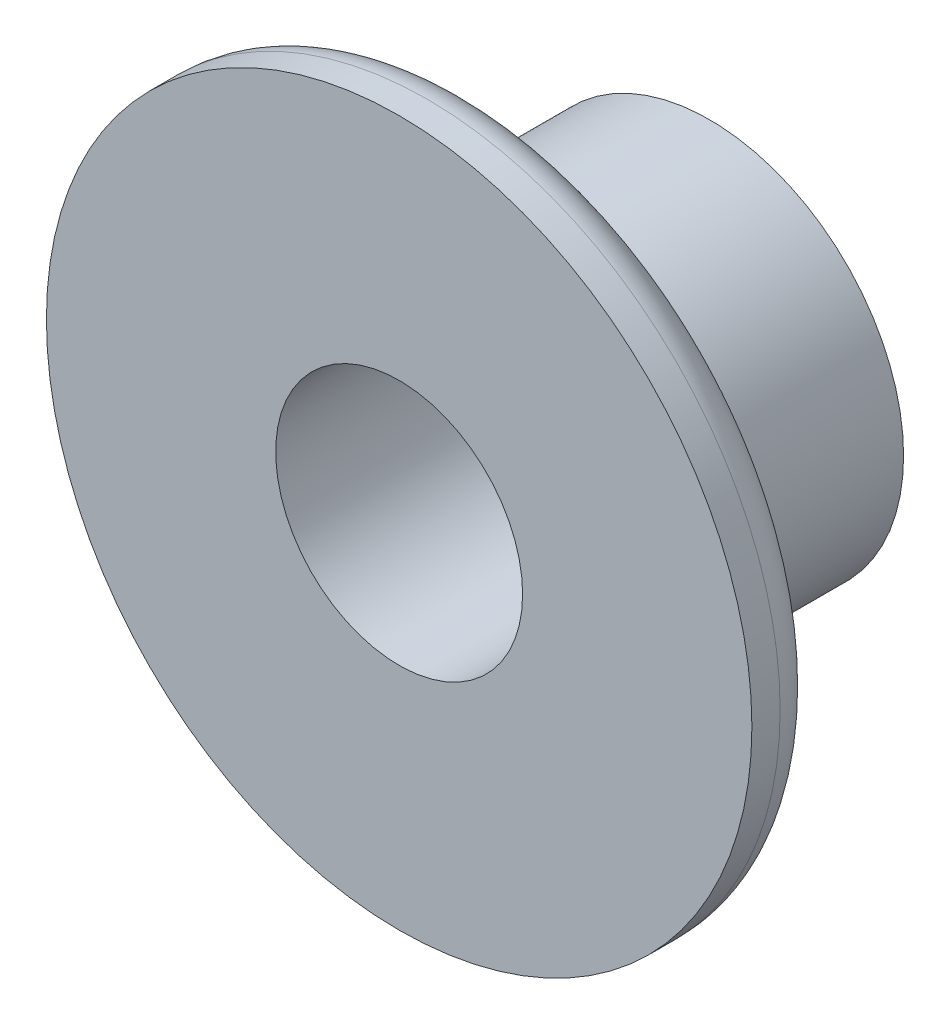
ISO-10303-21;
HEADER;
FILE_DESCRIPTION(('STEP AP214'),'2;1');
FILE_NAME('part.step','',(''),(''),'','','');
FILE_SCHEMA(('AUTOMOTIVE_DESIGN { 1 0 10303 214 1 1 1 1 }'));
ENDSEC;
DATA;
#1=APPLICATION_CONTEXT('core data for automotive mechanical design processes');
#2=APPLICATION_PROTOCOL_DEFINITION('international standard','automotive_design',2000,#1);
#3=PRODUCT_CONTEXT('',#1,'mechanical');
#4=PRODUCT('Part','Part','',(#3));
#5=PRODUCT_RELATED_PRODUCT_CATEGORY('part','',(#4));
#6=PRODUCT_DEFINITION_FORMATION('','',#4);
#7=PRODUCT_DEFINITION_CONTEXT('part definition',#1,'design');
#8=PRODUCT_DEFINITION('design','',#6,#7);
#9=PRODUCT_DEFINITION_SHAPE('','',#8);
#10=(LENGTH_UNIT() NAMED_UNIT(*) SI_UNIT(.MILLI.,.METRE.));
#11=(NAMED_UNIT(*) PLANE_ANGLE_UNIT() SI_UNIT($,.RADIAN.));
#12=(NAMED_UNIT(*) SI_UNIT($,.STERADIAN.) SOLID_ANGLE_UNIT());
#13=UNCERTAINTY_MEASURE_WITH_UNIT(LENGTH_MEASURE(1.E-05),#10,'distance_accuracy_value','');
#14=(GEOMETRIC_REPRESENTATION_CONTEXT(3) GLOBAL_UNCERTAINTY_ASSIGNED_CONTEXT((#13)) GLOBAL_UNIT_ASSIGNED_CONTEXT((#10,
#11,#12)) REPRESENTATION_CONTEXT('',''));
#15=CARTESIAN_POINT('',(0.,0.,0.));
#16=DIRECTION('',(0.,0.,1.));
#17=DIRECTION('',(1.,0.,0.));
#18=AXIS2_PLACEMENT_3D('',#15,#16,#17);
#19=CARTESIAN_POINT('',(0.,0.,5.588));
#20=DIRECTION('',(0.,0.,-1.));
#21=DIRECTION('',(-1.,0.,0.));
#22=AXIS2_PLACEMENT_3D('',#19,#20,#21);
#23=CYLINDRICAL_SURFACE('',#22,3.4925);
#24=CARTESIAN_POINT('',(0.,0.,3.556));
#25=DIRECTION('',(0.,0.,1.));
#26=DIRECTION('',(1.,0.,0.));
#27=AXIS2_PLACEMENT_3D('',#24,#25,#26);
#28=CIRCLE('',#27,3.4925);
#29=CARTESIAN_POINT('',(3.4925,0.,3.556));
#30=VERTEX_POINT('',#29);
#31=EDGE_CURVE('E37',#30,#30,#28,.F.);
#32=ORIENTED_EDGE('',*,*,#31,.T.);
#33=EDGE_LOOP('',(#32));
#34=FACE_BOUND('',#33,.T.);
#35=CARTESIAN_POINT('',(0.,0.,0.));
#36=DIRECTION('',(0.,0.,1.));
#37=DIRECTION('',(1.,0.,0.));
#38=AXIS2_PLACEMENT_3D('',#35,#36,#37);
#39=CIRCLE('',#38,3.4925);
#40=CARTESIAN_POINT('',(3.4925,0.,0.));
#41=VERTEX_POINT('',#40);
#42=EDGE_CURVE('E50',#41,#41,#39,.T.);
#43=ORIENTED_EDGE('',*,*,#42,.T.);
#44=EDGE_LOOP('',(#43));
#45=FACE_BOUND('',#44,.T.);
#46=ADVANCED_FACE('F30',(#34,#45),#23,.T.);
#47=CARTESIAN_POINT('',(0.,0.,5.588));
#48=DIRECTION('',(0.,0.,1.));
#49=DIRECTION('',(1.,0.,0.));
#50=AXIS2_PLACEMENT_3D('',#47,#48,#49);
#51=PLANE('',#50);
#52=CARTESIAN_POINT('',(0.,0.,5.588));
#53=DIRECTION('',(0.,0.,1.));
#54=DIRECTION('',(1.,0.,0.));
#55=AXIS2_PLACEMENT_3D('',#52,#53,#54);
#56=CIRCLE('',#55,2.2225);
#57=CARTESIAN_POINT('',(2.2225,0.,5.588));
#58=VERTEX_POINT('',#57);
#59=EDGE_CURVE('E53',#58,#58,#56,.T.);
#60=ORIENTED_EDGE('',*,*,#59,.F.);
#61=EDGE_LOOP('',(#60));
#62=FACE_BOUND('',#61,.T.);
#63=CARTESIAN_POINT('',(0.,0.,5.588));
#64=DIRECTION('',(0.,0.,1.));
#65=DIRECTION('',(1.,0.,0.));
#66=AXIS2_PLACEMENT_3D('',#63,#64,#65);
#67=CIRCLE('',#66,6.35);
#68=CARTESIAN_POINT('',(6.35,0.,5.588));
#69=VERTEX_POINT('',#68);
#70=EDGE_CURVE('E57',#69,#69,#67,.T.);
#71=ORIENTED_EDGE('',*,*,#70,.T.);
#72=EDGE_LOOP('',(#71));
#73=FACE_BOUND('',#72,.T.);
#74=ADVANCED_FACE('F63',(#62,#73),#51,.T.);
#75=CARTESIAN_POINT('',(0.,0.,0.));
#76=DIRECTION('',(0.,0.,1.));
#77=DIRECTION('',(1.,0.,0.));
#78=AXIS2_PLACEMENT_3D('',#75,#76,#77);
#79=PLANE('',#78);
#80=ORIENTED_EDGE('',*,*,#42,.F.);
#81=EDGE_LOOP('',(#80));
#82=FACE_BOUND('',#81,.T.);
#83=CARTESIAN_POINT('',(0.,0.,0.));
#84=DIRECTION('',(0.,0.,1.));
#85=DIRECTION('',(1.,0.,0.));
#86=AXIS2_PLACEMENT_3D('',#83,#84,#85);
#87=CIRCLE('',#86,2.2225);
#88=CARTESIAN_POINT('',(2.2225,0.,0.));
#89=VERTEX_POINT('',#88);
#90=EDGE_CURVE('E54',#89,#89,#87,.T.);
#91=ORIENTED_EDGE('',*,*,#90,.T.);
#92=EDGE_LOOP('',(#91));
#93=FACE_BOUND('',#92,.T.);
#94=ADVANCED_FACE('F84',(#82,#93),#79,.F.);
#95=CARTESIAN_POINT('',(0.,0.,5.588));
#96=DIRECTION('',(0.,0.,-1.));
#97=DIRECTION('',(-1.,0.,0.));
#98=AXIS2_PLACEMENT_3D('',#95,#96,#97);
#99=CYLINDRICAL_SURFACE('',#98,2.2225);
#100=ORIENTED_EDGE('',*,*,#59,.T.);
#101=EDGE_LOOP('',(#100));
#102=FACE_BOUND('',#101,.T.);
#103=ORIENTED_EDGE('',*,*,#90,.F.);
#104=EDGE_LOOP('',(#103));
#105=FACE_BOUND('',#104,.T.);
#106=ADVANCED_FACE('F75',(#102,#105),#99,.F.);
#107=CARTESIAN_POINT('',(0.,0.,4.318));
#108=DIRECTION('',(0.,0.,1.));
#109=DIRECTION('',(1.,0.,0.));
#110=AXIS2_PLACEMENT_3D('',#107,#108,#109);
#111=PLANE('',#110);
#112=CARTESIAN_POINT('',(0.,0.,4.318));
#113=DIRECTION('',(0.,0.,1.));
#114=DIRECTION('',(1.,0.,0.));
#115=AXIS2_PLACEMENT_3D('',#112,#113,#114);
#116=CIRCLE('',#115,4.2545);
#117=CARTESIAN_POINT('',(4.2545,0.,4.318));
#118=VERTEX_POINT('',#117);
#119=EDGE_CURVE('E41',#118,#118,#116,.T.);
#120=ORIENTED_EDGE('',*,*,#119,.T.);
#121=EDGE_LOOP('',(#120));
#122=FACE_BOUND('',#121,.T.);
#123=CARTESIAN_POINT('',(0.,0.,4.318));
#124=DIRECTION('',(0.,0.,1.));
#125=DIRECTION('',(1.,0.,0.));
#126=AXIS2_PLACEMENT_3D('',#123,#124,#125);
#127=CIRCLE('',#126,5.588);
#128=CARTESIAN_POINT('',(5.588,0.,4.318));
#129=VERTEX_POINT('',#128);
#130=EDGE_CURVE('E45',#129,#129,#127,.F.);
#131=ORIENTED_EDGE('',*,*,#130,.T.);
#132=EDGE_LOOP('',(#131));
#133=FACE_BOUND('',#132,.T.);
#134=ADVANCED_FACE('F68',(#122,#133),#111,.F.);
#135=CARTESIAN_POINT('',(0.,0.,4.318));
#136=DIRECTION('',(0.,0.,1.));
#137=DIRECTION('',(1.,0.,0.));
#138=AXIS2_PLACEMENT_3D('',#135,#136,#137);
#139=CYLINDRICAL_SURFACE('',#138,6.35);
#140=CARTESIAN_POINT('',(0.,0.,5.08));
#141=DIRECTION('',(0.,0.,1.));
#142=DIRECTION('',(1.,0.,0.));
#143=AXIS2_PLACEMENT_3D('',#140,#141,#142);
#144=CIRCLE('',#143,6.35);
#145=CARTESIAN_POINT('',(6.35,0.,5.08));
#146=VERTEX_POINT('',#145);
#147=EDGE_CURVE('E10',#146,#146,#144,.T.);
#148=ORIENTED_EDGE('',*,*,#147,.T.);
#149=EDGE_LOOP('',(#148));
#150=FACE_BOUND('',#149,.T.);
#151=ORIENTED_EDGE('',*,*,#70,.F.);
#152=EDGE_LOOP('',(#151));
#153=FACE_BOUND('',#152,.T.);
#154=ADVANCED_FACE('F65',(#150,#153),#139,.T.);
#155=CARTESIAN_POINT('',(0.,0.,3.556));
#156=DIRECTION('',(0.,0.,1.));
#157=DIRECTION('',(1.,0.,0.));
#158=AXIS2_PLACEMENT_3D('',#155,#156,#157);
#159=TOROIDAL_SURFACE('',#158,4.2545,0.762);
#160=ORIENTED_EDGE('',*,*,#31,.F.);
#161=EDGE_LOOP('',(#160));
#162=FACE_BOUND('',#161,.T.);
#163=ORIENTED_EDGE('',*,*,#119,.F.);
#164=EDGE_LOOP('',(#163));
#165=FACE_BOUND('',#164,.T.);
#166=ADVANCED_FACE('F67',(#162,#165),#159,.F.);
#167=CARTESIAN_POINT('',(0.,0.,5.08));
#168=DIRECTION('',(0.,0.,1.));
#169=DIRECTION('',(1.,0.,0.));
#170=AXIS2_PLACEMENT_3D('',#167,#168,#169);
#171=TOROIDAL_SURFACE('',#170,5.588,0.762);
#172=ORIENTED_EDGE('',*,*,#130,.F.);
#173=EDGE_LOOP('',(#172));
#174=FACE_BOUND('',#173,.T.);
#175=ORIENTED_EDGE('',*,*,#147,.F.);
#176=EDGE_LOOP('',(#175));
#177=FACE_BOUND('',#176,.T.);
#178=ADVANCED_FACE('F32',(#174,#177),#171,.T.);
#179=CLOSED_SHELL('',(#46,#74,#94,#106,#134,#154,#166,#178));
#180=MANIFOLD_SOLID_BREP('B2',#179);
#181=ADVANCED_BREP_SHAPE_REPRESENTATION('',(#18,#180),#14);
#182=SHAPE_DEFINITION_REPRESENTATION(#9,#181);
ENDSEC;
END-ISO-10303-21;
